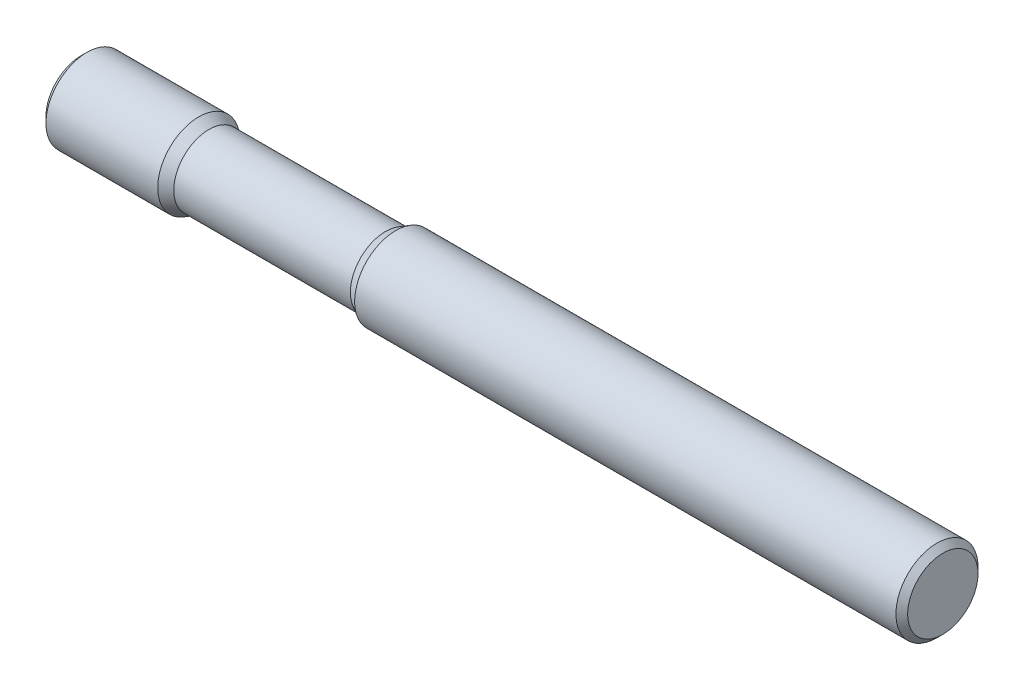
from build123d import *


with BuildPart() as part:
    # Esquisse1 → R_volution1 (revolve)
    with BuildSketch(Plane.XY, mode=Mode.PRIVATE) as r_volution1_sk:
        Polygon((0, 0), (0, 12.8529775), (2.1470225, 15), (43, 15), (46.718752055, 12.8529775), (111.281247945, 12.8529775), (115, 15), (312.8529775, 15), (315, 12.8529775), (315, 0), align=None)
    revolve(r_volution1_sk.sketch.rotate(Axis((315, 0, 0), (-1, 0, 0)), 90), axis=Axis((315, 0, 0), (-1, 0, 0)))


solid = part.part
